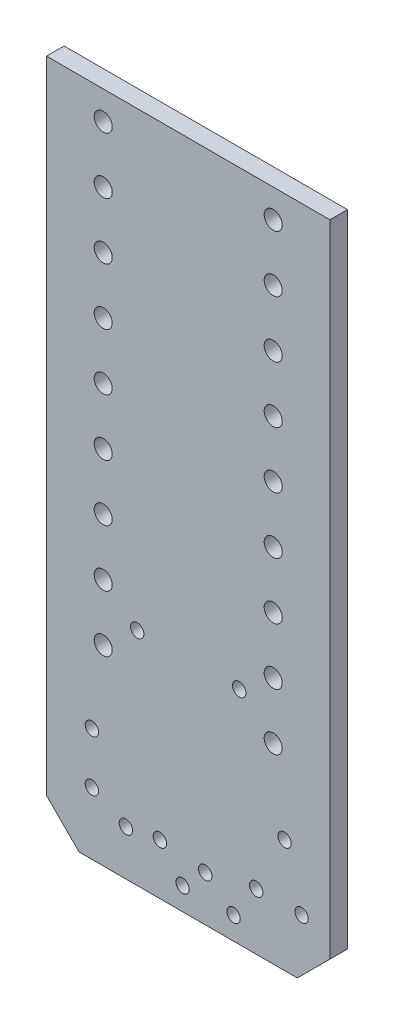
from build123d import *

# Parameters (mm, degrees)
BOARD_OUTLINE_DEPTH = 0.7874
SKETCH2_R           = 0.3
NPTH_DEPTH          = 33.736621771
SKETCH3_R           = 0.405
PTH_DEPTH           = 33.736621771


with BuildPart() as part:
    # Sketch1 → Board_Outline (new body)
    with BuildSketch(Plane.XY):
        Polygon((0, 1.4605), (0, 30.1625), (12.7, 30.1625), (12.7, 1.4605), (11.2395, 0), (1.4605, 0), align=None)
    extrude(amount=BOARD_OUTLINE_DEPTH)

    # Sketch2 → NPTH (cut, through all)
    with BuildSketch(Plane.XY):
        with Locations((2.032, 5.08)):
            Circle(SKETCH2_R)
        with Locations((6.096, 1.016)):
            Circle(SKETCH2_R)
        with Locations((5.08, 2.286)):
            Circle(SKETCH2_R)
        with Locations((3.556, 2.032)):
            Circle(SKETCH2_R)
        with Locations((2.032, 2.794)):
            Circle(SKETCH2_R)
        with Locations((4.064, 9.906)):
            Circle(SKETCH2_R)
        with Locations((8.636, 9.906)):
            Circle(SKETCH2_R)
        with Locations((11.43, 2.54)):
            Circle(SKETCH2_R)
        with Locations((9.398, 2.54)):
            Circle(SKETCH2_R)
        with Locations((8.382, 1.016)):
            Circle(SKETCH2_R)
        with Locations((7.112, 2.032)):
            Circle(SKETCH2_R)
        with Locations((10.668, 5.08)):
            Circle(SKETCH2_R)
    extrude(amount=NPTH_DEPTH, mode=Mode.SUBTRACT)

    # Sketch3 → PTH (cut, through all)
    with BuildSketch(Plane.XY):
        with Locations((2.54, 8.57)):
            Circle(SKETCH3_R)
        with Locations((10.16, 8.57)):
            Circle(SKETCH3_R)
        with Locations((2.54, 28.89)):
            Circle(SKETCH3_R)
        with Locations((2.54, 26.35)):
            Circle(SKETCH3_R)
        with Locations((2.54, 23.81)):
            Circle(SKETCH3_R)
        with Locations((2.54, 21.27)):
            Circle(SKETCH3_R)
        with Locations((2.54, 18.73)):
            Circle(SKETCH3_R)
        with Locations((2.54, 16.19)):
            Circle(SKETCH3_R)
        with Locations((2.54, 13.65)):
            Circle(SKETCH3_R)
        with Locations((2.54, 11.11)):
            Circle(SKETCH3_R)
        with Locations((10.16, 11.11)):
            Circle(SKETCH3_R)
        with Locations((10.16, 13.65)):
            Circle(SKETCH3_R)
        with Locations((10.16, 16.19)):
            Circle(SKETCH3_R)
        with Locations((10.16, 18.73)):
            Circle(SKETCH3_R)
        with Locations((10.16, 21.27)):
            Circle(SKETCH3_R)
        with Locations((10.16, 23.81)):
            Circle(SKETCH3_R)
        with Locations((10.16, 26.35)):
            Circle(SKETCH3_R)
        with Locations((10.16, 28.89)):
            Circle(SKETCH3_R)
    extrude(amount=PTH_DEPTH, mode=Mode.SUBTRACT)


solid = part.part
